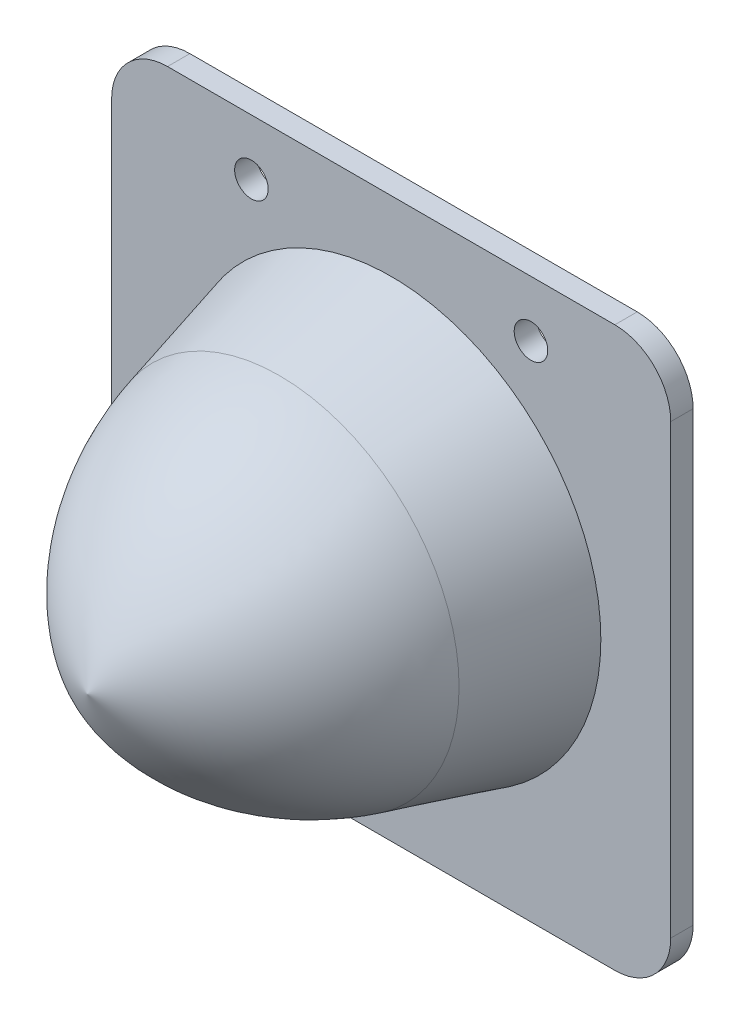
from build123d import *

# Parameters (mm, degrees)
SKETCH1_W           = 100
SKETCH1_H           = 100
BOSS_EXTRUDE1_DEPTH = 4
FILLET1_R           = 10
SKETCH3_R           = 3
CUT_EXTRUDE2_DEPTH  = 20
SKETCH4_R           = 37.5
BOSS_EXTRUDE3_DEPTH = 20
BOSS_EXTRUDE3_TAPER = 15
SKETCH6_R           = 1.5
CUT_EXTRUDE3_DEPTH  = 10
SKETCH9_R           = 12.5
CUT_EXTRUDE4_DEPTH  = 10


with BuildPart() as part:
    # Sketch1 → Boss-Extrude1 (new body)
    with BuildSketch(Plane.XY):
        Rectangle(SKETCH1_W, SKETCH1_H)
    extrude(amount=BOSS_EXTRUDE1_DEPTH)

    # Fillet1
    fillet1_edges = [part.edges().sort_by_distance(p)[0] for p in [
        (50, -50, 2),
        (-50, -50, 2),
        (-50, 50, 2),
        (50, 50, 2),
    ]]
    fillet(fillet1_edges, radius=FILLET1_R)

    # Sketch3 → Cut-Extrude2 (cut)
    with BuildSketch(Plane.XY.offset(4)):
        with Locations((25, 40)):
            Circle(SKETCH3_R)
        with Locations((-25, 40)):
            Circle(SKETCH3_R)
    extrude(amount=-CUT_EXTRUDE2_DEPTH, mode=Mode.SUBTRACT)

    # Sketch4 → Boss-Extrude3 (add)
    with BuildSketch(Plane.XY.offset(4)):
        Circle(SKETCH4_R)
    extrude(amount=BOSS_EXTRUDE3_DEPTH, taper=BOSS_EXTRUDE3_TAPER)

    # Sketch5 → Revolve1 (revolve)
    with BuildSketch(Plane(origin=(0, 0, 0), x_dir=(1, 0, 0), z_dir=(0, 1, 0))):
        with BuildLine():
            Line((-32.141016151, -24), (0, -24))
            Line((0, -24), (0, -58.377195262))
            ThreePointArc((0, -58.377195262), (-20.36799131, -45.206536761), (-32.141016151, -24))
        make_face()
    revolve(axis=Axis((0, 0, 24), (0, 0, 1)))

    # Sketch6 → Cut-Extrude3 (cut)
    with BuildSketch(Plane(origin=(0, 0, 0), x_dir=(-1, 0, 0), z_dir=(0, 0, -1))):
        with Locations((-10, 0)):
            Circle(SKETCH6_R)
        with Locations((10, 0)):
            Circle(SKETCH6_R)
        with Locations((0, 10)):
            Circle(SKETCH6_R)
        with Locations((0, -10)):
            Circle(SKETCH6_R)
    extrude(amount=-CUT_EXTRUDE3_DEPTH, mode=Mode.SUBTRACT)

    # Sketch9 → Cut-Extrude4 (cut)
    with BuildSketch(Plane(origin=(0, 0, 0), x_dir=(-1, 0, 0), z_dir=(0, 0, -1))):
        Circle(SKETCH9_R)
    extrude(amount=-CUT_EXTRUDE4_DEPTH, mode=Mode.SUBTRACT)


solid = part.part
